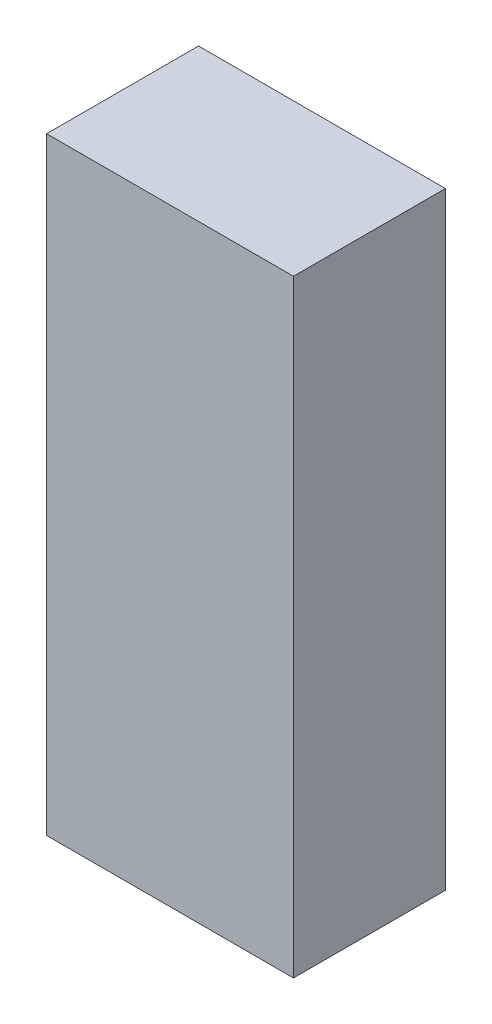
ISO-10303-21;
HEADER;
FILE_DESCRIPTION(('STEP AP214'),'2;1');
FILE_NAME('part.step','',(''),(''),'','','');
FILE_SCHEMA(('AUTOMOTIVE_DESIGN { 1 0 10303 214 1 1 1 1 }'));
ENDSEC;
DATA;
#1=APPLICATION_CONTEXT('core data for automotive mechanical design processes');
#2=APPLICATION_PROTOCOL_DEFINITION('international standard','automotive_design',2000,#1);
#3=PRODUCT_CONTEXT('',#1,'mechanical');
#4=PRODUCT('Part','Part','',(#3));
#5=PRODUCT_RELATED_PRODUCT_CATEGORY('part','',(#4));
#6=PRODUCT_DEFINITION_FORMATION('','',#4);
#7=PRODUCT_DEFINITION_CONTEXT('part definition',#1,'design');
#8=PRODUCT_DEFINITION('design','',#6,#7);
#9=PRODUCT_DEFINITION_SHAPE('','',#8);
#10=(LENGTH_UNIT() NAMED_UNIT(*) SI_UNIT(.MILLI.,.METRE.));
#11=(NAMED_UNIT(*) PLANE_ANGLE_UNIT() SI_UNIT($,.RADIAN.));
#12=(NAMED_UNIT(*) SI_UNIT($,.STERADIAN.) SOLID_ANGLE_UNIT());
#13=UNCERTAINTY_MEASURE_WITH_UNIT(LENGTH_MEASURE(1.E-05),#10,'distance_accuracy_value','');
#14=(GEOMETRIC_REPRESENTATION_CONTEXT(3) GLOBAL_UNCERTAINTY_ASSIGNED_CONTEXT((#13)) GLOBAL_UNIT_ASSIGNED_CONTEXT((#10,
#11,#12)) REPRESENTATION_CONTEXT('',''));
#15=CARTESIAN_POINT('',(0.,0.,0.));
#16=DIRECTION('',(0.,0.,1.));
#17=DIRECTION('',(1.,0.,0.));
#18=AXIS2_PLACEMENT_3D('',#15,#16,#17);
#19=CARTESIAN_POINT('',(41.275,457.2,-25.4));
#20=DIRECTION('',(-1.,0.,0.));
#21=DIRECTION('',(0.,0.,1.));
#22=AXIS2_PLACEMENT_3D('',#19,#20,#21);
#23=PLANE('',#22);
#24=DIRECTION('',(0.,-1.,0.));
#25=VECTOR('',#24,1.);
#26=CARTESIAN_POINT('',(41.275,457.2,25.4));
#27=LINE('',#26,#25);
#28=CARTESIAN_POINT('',(41.275,457.2,25.4));
#29=VERTEX_POINT('',#28);
#30=CARTESIAN_POINT('',(41.275,254.,25.4));
#31=VERTEX_POINT('',#30);
#32=EDGE_CURVE('E91',#29,#31,#27,.T.);
#33=ORIENTED_EDGE('',*,*,#32,.T.);
#34=DIRECTION('',(0.,0.,-1.));
#35=VECTOR('',#34,1.);
#36=CARTESIAN_POINT('',(41.275,254.,25.4));
#37=LINE('',#36,#35);
#38=CARTESIAN_POINT('',(41.275,254.,-25.4));
#39=VERTEX_POINT('',#38);
#40=EDGE_CURVE('E48',#31,#39,#37,.T.);
#41=ORIENTED_EDGE('',*,*,#40,.T.);
#42=DIRECTION('',(0.,-1.,0.));
#43=VECTOR('',#42,1.);
#44=CARTESIAN_POINT('',(41.275,457.2,-25.4));
#45=LINE('',#44,#43);
#46=CARTESIAN_POINT('',(41.275,457.2,-25.4));
#47=VERTEX_POINT('',#46);
#48=EDGE_CURVE('E11',#47,#39,#45,.T.);
#49=ORIENTED_EDGE('',*,*,#48,.F.);
#50=DIRECTION('',(0.,0.,-1.));
#51=VECTOR('',#50,1.);
#52=CARTESIAN_POINT('',(41.275,457.2,-25.4));
#53=LINE('',#52,#51);
#54=EDGE_CURVE('E100',#29,#47,#53,.T.);
#55=ORIENTED_EDGE('',*,*,#54,.F.);
#56=EDGE_LOOP('',(#33,#41,#49,#55));
#57=FACE_BOUND('',#56,.T.);
#58=ADVANCED_FACE('F34',(#57),#23,.F.);
#59=CARTESIAN_POINT('',(-41.275,457.2,-25.4));
#60=DIRECTION('',(0.,0.,1.));
#61=DIRECTION('',(1.,0.,0.));
#62=AXIS2_PLACEMENT_3D('',#59,#60,#61);
#63=PLANE('',#62);
#64=ORIENTED_EDGE('',*,*,#48,.T.);
#65=DIRECTION('',(1.,0.,0.));
#66=VECTOR('',#65,1.);
#67=CARTESIAN_POINT('',(-41.275,254.,-25.4));
#68=LINE('',#67,#66);
#69=CARTESIAN_POINT('',(-41.275,254.,-25.4));
#70=VERTEX_POINT('',#69);
#71=EDGE_CURVE('E80',#70,#39,#68,.T.);
#72=ORIENTED_EDGE('',*,*,#71,.F.);
#73=DIRECTION('',(0.,-1.,0.));
#74=VECTOR('',#73,1.);
#75=CARTESIAN_POINT('',(-41.275,457.2,-25.4));
#76=LINE('',#75,#74);
#77=CARTESIAN_POINT('',(-41.275,457.2,-25.4));
#78=VERTEX_POINT('',#77);
#79=EDGE_CURVE('E41',#78,#70,#76,.T.);
#80=ORIENTED_EDGE('',*,*,#79,.F.);
#81=DIRECTION('',(-1.,0.,0.));
#82=VECTOR('',#81,1.);
#83=CARTESIAN_POINT('',(-41.275,457.2,-25.4));
#84=LINE('',#83,#82);
#85=EDGE_CURVE('E98',#47,#78,#84,.T.);
#86=ORIENTED_EDGE('',*,*,#85,.F.);
#87=EDGE_LOOP('',(#64,#72,#80,#86));
#88=FACE_BOUND('',#87,.T.);
#89=ADVANCED_FACE('F107',(#88),#63,.F.);
#90=CARTESIAN_POINT('',(-41.275,457.2,-25.4));
#91=DIRECTION('',(1.,0.,0.));
#92=DIRECTION('',(0.,0.,-1.));
#93=AXIS2_PLACEMENT_3D('',#90,#91,#92);
#94=PLANE('',#93);
#95=ORIENTED_EDGE('',*,*,#79,.T.);
#96=DIRECTION('',(0.,0.,-1.));
#97=VECTOR('',#96,1.);
#98=CARTESIAN_POINT('',(-41.275,254.,25.4));
#99=LINE('',#98,#97);
#100=CARTESIAN_POINT('',(-41.275,254.,25.4));
#101=VERTEX_POINT('',#100);
#102=EDGE_CURVE('E75',#101,#70,#99,.T.);
#103=ORIENTED_EDGE('',*,*,#102,.F.);
#104=DIRECTION('',(0.,-1.,0.));
#105=VECTOR('',#104,1.);
#106=CARTESIAN_POINT('',(-41.275,457.2,25.4));
#107=LINE('',#106,#105);
#108=CARTESIAN_POINT('',(-41.275,457.2,25.4));
#109=VERTEX_POINT('',#108);
#110=EDGE_CURVE('E87',#109,#101,#107,.T.);
#111=ORIENTED_EDGE('',*,*,#110,.F.);
#112=DIRECTION('',(0.,0.,1.));
#113=VECTOR('',#112,1.);
#114=CARTESIAN_POINT('',(-41.275,457.2,-25.4));
#115=LINE('',#114,#113);
#116=EDGE_CURVE('E96',#78,#109,#115,.T.);
#117=ORIENTED_EDGE('',*,*,#116,.F.);
#118=EDGE_LOOP('',(#95,#103,#111,#117));
#119=FACE_BOUND('',#118,.T.);
#120=ADVANCED_FACE('F85',(#119),#94,.F.);
#121=CARTESIAN_POINT('',(-41.275,457.2,25.4));
#122=DIRECTION('',(0.,0.,-1.));
#123=DIRECTION('',(-1.,0.,0.));
#124=AXIS2_PLACEMENT_3D('',#121,#122,#123);
#125=PLANE('',#124);
#126=ORIENTED_EDGE('',*,*,#110,.T.);
#127=DIRECTION('',(1.,0.,0.));
#128=VECTOR('',#127,1.);
#129=CARTESIAN_POINT('',(-41.275,254.,25.4));
#130=LINE('',#129,#128);
#131=EDGE_CURVE('E72',#101,#31,#130,.T.);
#132=ORIENTED_EDGE('',*,*,#131,.T.);
#133=ORIENTED_EDGE('',*,*,#32,.F.);
#134=DIRECTION('',(1.,0.,0.));
#135=VECTOR('',#134,1.);
#136=CARTESIAN_POINT('',(-41.275,457.2,25.4));
#137=LINE('',#136,#135);
#138=EDGE_CURVE('E56',#109,#29,#137,.T.);
#139=ORIENTED_EDGE('',*,*,#138,.F.);
#140=EDGE_LOOP('',(#126,#132,#133,#139));
#141=FACE_BOUND('',#140,.T.);
#142=ADVANCED_FACE('F90',(#141),#125,.F.);
#143=CARTESIAN_POINT('',(0.,457.2,0.));
#144=DIRECTION('',(0.,1.,0.));
#145=DIRECTION('',(0.,0.,1.));
#146=AXIS2_PLACEMENT_3D('',#143,#144,#145);
#147=PLANE('',#146);
#148=ORIENTED_EDGE('',*,*,#54,.T.);
#149=ORIENTED_EDGE('',*,*,#85,.T.);
#150=ORIENTED_EDGE('',*,*,#116,.T.);
#151=ORIENTED_EDGE('',*,*,#138,.T.);
#152=EDGE_LOOP('',(#148,#149,#150,#151));
#153=FACE_BOUND('',#152,.T.);
#154=ADVANCED_FACE('F108',(#153),#147,.T.);
#155=CARTESIAN_POINT('',(-41.275,254.,25.4));
#156=DIRECTION('',(0.,1.,0.));
#157=DIRECTION('',(0.,0.,1.));
#158=AXIS2_PLACEMENT_3D('',#155,#156,#157);
#159=PLANE('',#158);
#160=ORIENTED_EDGE('',*,*,#71,.T.);
#161=ORIENTED_EDGE('',*,*,#40,.F.);
#162=ORIENTED_EDGE('',*,*,#131,.F.);
#163=ORIENTED_EDGE('',*,*,#102,.T.);
#164=EDGE_LOOP('',(#160,#161,#162,#163));
#165=FACE_BOUND('',#164,.T.);
#166=ADVANCED_FACE('F74',(#165),#159,.F.);
#167=CLOSED_SHELL('',(#58,#89,#120,#142,#154,#166));
#168=MANIFOLD_SOLID_BREP('B2',#167);
#169=ADVANCED_BREP_SHAPE_REPRESENTATION('',(#18,#168),#14);
#170=SHAPE_DEFINITION_REPRESENTATION(#9,#169);
ENDSEC;
END-ISO-10303-21;
